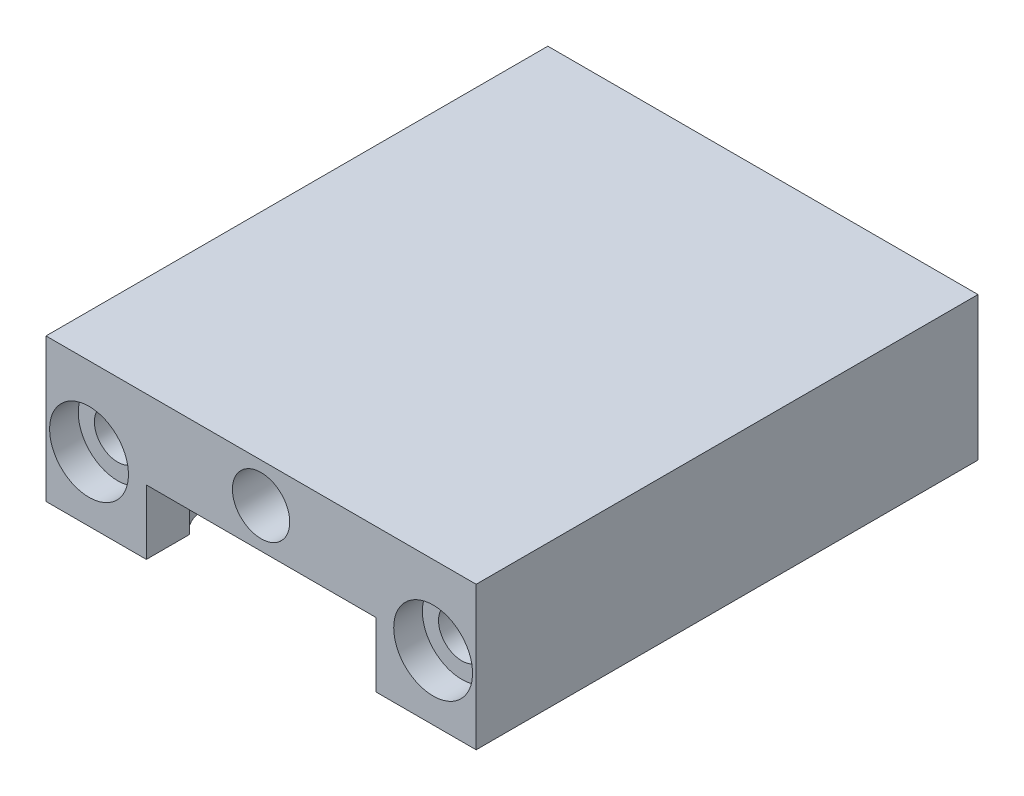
ISO-10303-21;
HEADER;
FILE_DESCRIPTION(('STEP AP214'),'2;1');
FILE_NAME('part.step','',(''),(''),'','','');
FILE_SCHEMA(('AUTOMOTIVE_DESIGN { 1 0 10303 214 1 1 1 1 }'));
ENDSEC;
DATA;
#1=APPLICATION_CONTEXT('core data for automotive mechanical design processes');
#2=APPLICATION_PROTOCOL_DEFINITION('international standard','automotive_design',2000,#1);
#3=PRODUCT_CONTEXT('',#1,'mechanical');
#4=PRODUCT('Part','Part','',(#3));
#5=PRODUCT_RELATED_PRODUCT_CATEGORY('part','',(#4));
#6=PRODUCT_DEFINITION_FORMATION('','',#4);
#7=PRODUCT_DEFINITION_CONTEXT('part definition',#1,'design');
#8=PRODUCT_DEFINITION('design','',#6,#7);
#9=PRODUCT_DEFINITION_SHAPE('','',#8);
#10=(LENGTH_UNIT() NAMED_UNIT(*) SI_UNIT(.MILLI.,.METRE.));
#11=(NAMED_UNIT(*) PLANE_ANGLE_UNIT() SI_UNIT($,.RADIAN.));
#12=(NAMED_UNIT(*) SI_UNIT($,.STERADIAN.) SOLID_ANGLE_UNIT());
#13=UNCERTAINTY_MEASURE_WITH_UNIT(LENGTH_MEASURE(1.E-05),#10,'distance_accuracy_value','');
#14=(GEOMETRIC_REPRESENTATION_CONTEXT(3) GLOBAL_UNCERTAINTY_ASSIGNED_CONTEXT((#13)) GLOBAL_UNIT_ASSIGNED_CONTEXT((#10,
#11,#12)) REPRESENTATION_CONTEXT('',''));
#15=CARTESIAN_POINT('',(0.,0.,0.));
#16=DIRECTION('',(0.,0.,1.));
#17=DIRECTION('',(1.,0.,0.));
#18=AXIS2_PLACEMENT_3D('',#15,#16,#17);
#19=CARTESIAN_POINT('',(-5.00000000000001,8.99999999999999,20.));
#20=DIRECTION('',(-1.,0.,0.));
#21=DIRECTION('',(0.,0.,1.));
#22=AXIS2_PLACEMENT_3D('',#19,#20,#21);
#23=PLANE('',#22);
#24=DIRECTION('',(0.,1.,0.));
#25=VECTOR('',#24,1.);
#26=CARTESIAN_POINT('',(-5.00000000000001,8.99999999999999,20.));
#27=LINE('',#26,#25);
#28=CARTESIAN_POINT('',(-5.00000000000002,9.49999999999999,20.));
#29=VERTEX_POINT('',#28);
#30=CARTESIAN_POINT('',(-5.00000000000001,8.99999999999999,20.));
#31=VERTEX_POINT('',#30);
#32=EDGE_CURVE('E239',#29,#31,#27,.F.);
#33=ORIENTED_EDGE('',*,*,#32,.T.);
#34=DIRECTION('',(0.,0.,1.));
#35=VECTOR('',#34,1.);
#36=CARTESIAN_POINT('',(-5.00000000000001,8.99999999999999,11.8202587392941));
#37=LINE('',#36,#35);
#38=CARTESIAN_POINT('',(-5.00000000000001,8.99999999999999,0.));
#39=VERTEX_POINT('',#38);
#40=EDGE_CURVE('E230',#31,#39,#37,.F.);
#41=ORIENTED_EDGE('',*,*,#40,.T.);
#42=DIRECTION('',(0.,1.,0.));
#43=VECTOR('',#42,1.);
#44=CARTESIAN_POINT('',(-5.00000000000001,8.99999999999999,0.));
#45=LINE('',#44,#43);
#46=CARTESIAN_POINT('',(-5.00000000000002,9.49999999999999,0.));
#47=VERTEX_POINT('',#46);
#48=EDGE_CURVE('E446',#47,#39,#45,.F.);
#49=ORIENTED_EDGE('',*,*,#48,.F.);
#50=DIRECTION('',(0.,0.,1.));
#51=VECTOR('',#50,1.);
#52=CARTESIAN_POINT('',(-5.00000000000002,9.49999999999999,11.5547539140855));
#53=LINE('',#52,#51);
#54=EDGE_CURVE('E240',#47,#29,#53,.T.);
#55=ORIENTED_EDGE('',*,*,#54,.T.);
#56=EDGE_LOOP('',(#33,#41,#49,#55));
#57=FACE_BOUND('',#56,.T.);
#58=ADVANCED_FACE('F15',(#57),#23,.F.);
#59=CARTESIAN_POINT('',(0.,8.99999999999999,20.));
#60=DIRECTION('',(0.,1.,0.));
#61=DIRECTION('',(0.,0.,1.));
#62=AXIS2_PLACEMENT_3D('',#59,#60,#61);
#63=CYLINDRICAL_SURFACE('',#62,5.);
#64=CARTESIAN_POINT('',(0.,8.99999999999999,20.));
#65=DIRECTION('',(0.,1.,0.));
#66=DIRECTION('',(0.,0.,1.));
#67=AXIS2_PLACEMENT_3D('',#64,#65,#66);
#68=CIRCLE('',#67,5.);
#69=CARTESIAN_POINT('',(-1.93649167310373,8.99999999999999,24.6097722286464));
#70=VERTEX_POINT('',#69);
#71=EDGE_CURVE('E529',#70,#31,#68,.F.);
#72=ORIENTED_EDGE('',*,*,#71,.T.);
#73=ORIENTED_EDGE('',*,*,#32,.F.);
#74=CARTESIAN_POINT('',(0.,9.49999999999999,20.));
#75=DIRECTION('',(0.,1.,0.));
#76=DIRECTION('',(0.,0.,1.));
#77=AXIS2_PLACEMENT_3D('',#74,#75,#76);
#78=CIRCLE('',#77,5.);
#79=CARTESIAN_POINT('',(0.,9.5,25.));
#80=VERTEX_POINT('',#79);
#81=EDGE_CURVE('E226',#29,#80,#78,.T.);
#82=ORIENTED_EDGE('',*,*,#81,.T.);
#83=CARTESIAN_POINT('',(0.,9.50000000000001,25.));
#84=CARTESIAN_POINT('',(-0.0969345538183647,9.50002196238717,25.0000231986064));
#85=CARTESIAN_POINT('',(-0.193853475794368,9.49647724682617,24.9971819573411));
#86=CARTESIAN_POINT('',(-0.386811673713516,9.48242167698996,24.9859452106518));
#87=CARTESIAN_POINT('',(-0.482851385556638,9.4719144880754,24.977552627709));
#88=CARTESIAN_POINT('',(-0.670943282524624,9.4444459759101,24.9556624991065));
#89=CARTESIAN_POINT('',(-0.763035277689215,9.42765128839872,24.9422968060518));
#90=CARTESIAN_POINT('',(-0.945001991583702,9.38788507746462,24.9107539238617));
#91=CARTESIAN_POINT('',(-1.03487688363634,9.36491403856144,24.8925771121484));
#92=CARTESIAN_POINT('',(-1.26584677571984,9.29731796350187,24.8393137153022));
#93=CARTESIAN_POINT('',(-1.40480523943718,9.24802480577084,24.8006702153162));
#94=CARTESIAN_POINT('',(-1.60788715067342,9.16336642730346,24.7349689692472));
#95=CARTESIAN_POINT('',(-1.67535870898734,9.13298775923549,24.7114941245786));
#96=CARTESIAN_POINT('',(-1.80780682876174,9.06892572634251,24.6622755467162));
#97=CARTESIAN_POINT('',(-1.87278489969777,9.03524440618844,24.6365332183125));
#98=CARTESIAN_POINT('',(-1.93649167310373,8.99999999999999,24.6097722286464));
#99=B_SPLINE_CURVE_WITH_KNOTS('',3,(#83,#84,#85,#86,#87,#88,#89,#90,#91,#92,#93,#94,#95,#96,#97,
#98),.UNSPECIFIED.,.F.,.F.,(4,2,2,2,2,2,2,4),(0.,0.290672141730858,0.58119138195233,
0.864501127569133,1.1477886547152,1.60358219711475,1.83635601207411,2.06898661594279),.UNSPECIFIED.);
#100=EDGE_CURVE('E237',#80,#70,#99,.T.);
#101=ORIENTED_EDGE('',*,*,#100,.T.);
#102=EDGE_LOOP('',(#72,#73,#82,#101));
#103=FACE_BOUND('',#102,.T.);
#104=ADVANCED_FACE('F236',(#103),#63,.F.);
#105=CARTESIAN_POINT('',(0.,8.99999999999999,20.));
#106=DIRECTION('',(0.,1.,0.));
#107=DIRECTION('',(0.,0.,1.));
#108=AXIS2_PLACEMENT_3D('',#105,#106,#107);
#109=CYLINDRICAL_SURFACE('',#108,5.);
#110=CARTESIAN_POINT('',(0.,9.49999999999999,20.));
#111=DIRECTION('',(0.,1.,0.));
#112=DIRECTION('',(0.,0.,1.));
#113=AXIS2_PLACEMENT_3D('',#110,#111,#112);
#114=CIRCLE('',#113,5.);
#115=CARTESIAN_POINT('',(4.99999999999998,9.49999999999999,20.));
#116=VERTEX_POINT('',#115);
#117=EDGE_CURVE('E209',#80,#116,#114,.T.);
#118=ORIENTED_EDGE('',*,*,#117,.T.);
#119=DIRECTION('',(0.,1.,0.));
#120=VECTOR('',#119,1.);
#121=CARTESIAN_POINT('',(4.99999999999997,8.99999999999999,20.));
#122=LINE('',#121,#120);
#123=CARTESIAN_POINT('',(4.99999999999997,8.99999999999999,20.));
#124=VERTEX_POINT('',#123);
#125=EDGE_CURVE('E440',#116,#124,#122,.F.);
#126=ORIENTED_EDGE('',*,*,#125,.T.);
#127=CARTESIAN_POINT('',(0.,8.99999999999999,20.));
#128=DIRECTION('',(0.,1.,0.));
#129=DIRECTION('',(0.,0.,1.));
#130=AXIS2_PLACEMENT_3D('',#127,#128,#129);
#131=CIRCLE('',#130,5.);
#132=CARTESIAN_POINT('',(1.93649167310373,8.99999999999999,24.6097722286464));
#133=VERTEX_POINT('',#132);
#134=EDGE_CURVE('E212',#124,#133,#131,.F.);
#135=ORIENTED_EDGE('',*,*,#134,.T.);
#136=CARTESIAN_POINT('',(1.93649167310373,8.99999999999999,24.6097722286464));
#137=CARTESIAN_POINT('',(1.85675661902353,9.04412193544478,24.6432765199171));
#138=CARTESIAN_POINT('',(1.7749695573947,9.08580787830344,24.6751908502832));
#139=CARTESIAN_POINT('',(1.6075329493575,9.16392844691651,24.7353711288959));
#140=CARTESIAN_POINT('',(1.52187982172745,9.20035806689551,24.7636335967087));
#141=CARTESIAN_POINT('',(1.34934820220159,9.26663969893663,24.8153045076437));
#142=CARTESIAN_POINT('',(1.26255762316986,9.29663656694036,24.8388189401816));
#143=CARTESIAN_POINT('',(1.08618661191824,9.35080748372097,24.8814382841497));
#144=CARTESIAN_POINT('',(0.996607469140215,9.37498417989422,24.9005452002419));
#145=CARTESIAN_POINT('',(0.760581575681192,9.42984524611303,24.9440114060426));
#146=CARTESIAN_POINT('',(0.61225040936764,9.45573609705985,24.964647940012));
#147=CARTESIAN_POINT('',(0.385911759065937,9.48208902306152,24.9856803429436));
#148=CARTESIAN_POINT('',(0.309005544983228,9.48879475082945,24.9910392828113));
#149=CARTESIAN_POINT('',(0.154744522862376,9.49775243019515,24.9982017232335));
#150=CARTESIAN_POINT('',(0.0773895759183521,9.50000291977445,25.0000040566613));
#151=CARTESIAN_POINT('',(0.,9.50000000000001,25.));
#152=B_SPLINE_CURVE_WITH_KNOTS('',3,(#136,#137,#138,#139,#140,#141,#142,#143,#144,#145,#146,
#147,#148,#149,#150,#151),.UNSPECIFIED.,.F.,.F.,(4,2,2,2,2,2,2,4),(0.,0.291256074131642,
0.582787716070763,0.866834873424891,1.15075258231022,1.60495167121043,1.83692318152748,
2.06897080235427),.UNSPECIFIED.);
#153=EDGE_CURVE('E206',#133,#80,#152,.T.);
#154=ORIENTED_EDGE('',*,*,#153,.T.);
#155=EDGE_LOOP('',(#118,#126,#135,#154));
#156=FACE_BOUND('',#155,.T.);
#157=ADVANCED_FACE('F208',(#156),#109,.F.);
#158=CARTESIAN_POINT('',(4.99999999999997,8.99999999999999,0.));
#159=DIRECTION('',(1.,0.,0.));
#160=DIRECTION('',(0.,0.,-1.));
#161=AXIS2_PLACEMENT_3D('',#158,#159,#160);
#162=PLANE('',#161);
#163=DIRECTION('',(0.,1.,0.));
#164=VECTOR('',#163,1.);
#165=CARTESIAN_POINT('',(4.99999999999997,8.99999999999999,0.));
#166=LINE('',#165,#164);
#167=CARTESIAN_POINT('',(4.99999999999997,8.99999999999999,0.));
#168=VERTEX_POINT('',#167);
#169=CARTESIAN_POINT('',(4.99999999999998,9.49999999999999,0.));
#170=VERTEX_POINT('',#169);
#171=EDGE_CURVE('E442',#168,#170,#166,.T.);
#172=ORIENTED_EDGE('',*,*,#171,.F.);
#173=DIRECTION('',(0.,0.,1.));
#174=VECTOR('',#173,1.);
#175=CARTESIAN_POINT('',(4.99999999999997,8.99999999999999,11.8202587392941));
#176=LINE('',#175,#174);
#177=EDGE_CURVE('E525',#168,#124,#176,.T.);
#178=ORIENTED_EDGE('',*,*,#177,.T.);
#179=ORIENTED_EDGE('',*,*,#125,.F.);
#180=DIRECTION('',(0.,0.,1.));
#181=VECTOR('',#180,1.);
#182=CARTESIAN_POINT('',(4.99999999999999,9.49999999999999,11.5547539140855));
#183=LINE('',#182,#181);
#184=EDGE_CURVE('E229',#116,#170,#183,.F.);
#185=ORIENTED_EDGE('',*,*,#184,.T.);
#186=EDGE_LOOP('',(#172,#178,#179,#185));
#187=FACE_BOUND('',#186,.T.);
#188=ADVANCED_FACE('F278',(#187),#162,.F.);
#189=CARTESIAN_POINT('',(-15.,0.,59.1010205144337));
#190=DIRECTION('',(0.,-1.,0.));
#191=DIRECTION('',(0.,0.,-1.));
#192=AXIS2_PLACEMENT_3D('',#189,#190,#191);
#193=CYLINDRICAL_SURFACE('',#192,5.);
#194=CARTESIAN_POINT('',(-15.,-4.65000000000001,59.1010205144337));
#195=DIRECTION('',(0.,-1.,0.));
#196=DIRECTION('',(0.,0.,-1.));
#197=AXIS2_PLACEMENT_3D('',#194,#195,#196);
#198=CIRCLE('',#197,5.);
#199=CARTESIAN_POINT('',(-20.,-4.65000000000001,59.1010205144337));
#200=VERTEX_POINT('',#199);
#201=CARTESIAN_POINT('',(-16.,-4.65000000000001,64.));
#202=VERTEX_POINT('',#201);
#203=EDGE_CURVE('E535',#200,#202,#198,.F.);
#204=ORIENTED_EDGE('',*,*,#203,.F.);
#205=DIRECTION('',(0.,1.,0.));
#206=VECTOR('',#205,1.);
#207=CARTESIAN_POINT('',(-20.,0.,59.1010205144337));
#208=LINE('',#207,#206);
#209=CARTESIAN_POINT('',(-20.,0.,59.1010205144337));
#210=VERTEX_POINT('',#209);
#211=EDGE_CURVE('E457',#200,#210,#208,.T.);
#212=ORIENTED_EDGE('',*,*,#211,.T.);
#213=CARTESIAN_POINT('',(-15.,0.,59.1010205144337));
#214=DIRECTION('',(0.,-1.,0.));
#215=DIRECTION('',(0.,0.,-1.));
#216=AXIS2_PLACEMENT_3D('',#213,#214,#215);
#217=CIRCLE('',#216,5.);
#218=CARTESIAN_POINT('',(-16.,0.,64.));
#219=VERTEX_POINT('',#218);
#220=EDGE_CURVE('E518',#219,#210,#217,.T.);
#221=ORIENTED_EDGE('',*,*,#220,.F.);
#222=DIRECTION('',(0.,1.,0.));
#223=VECTOR('',#222,1.);
#224=CARTESIAN_POINT('',(-16.,0.,64.));
#225=LINE('',#224,#223);
#226=EDGE_CURVE('E558',#202,#219,#225,.T.);
#227=ORIENTED_EDGE('',*,*,#226,.F.);
#228=EDGE_LOOP('',(#204,#212,#221,#227));
#229=FACE_BOUND('',#228,.T.);
#230=ADVANCED_FACE('F281',(#229),#193,.F.);
#231=CARTESIAN_POINT('',(-5.00000000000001,0.,20.));
#232=DIRECTION('',(0.,1.,0.));
#233=DIRECTION('',(0.,0.,1.));
#234=AXIS2_PLACEMENT_3D('',#231,#232,#233);
#235=CYLINDRICAL_SURFACE('',#234,5.);
#236=DIRECTION('',(0.,1.,0.));
#237=VECTOR('',#236,1.);
#238=CARTESIAN_POINT('',(-5.00000000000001,0.,25.));
#239=LINE('',#238,#237);
#240=CARTESIAN_POINT('',(-5.00000000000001,8.99999999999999,25.));
#241=VERTEX_POINT('',#240);
#242=CARTESIAN_POINT('',(-5.00000000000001,0.,25.));
#243=VERTEX_POINT('',#242);
#244=EDGE_CURVE('E444',#241,#243,#239,.F.);
#245=ORIENTED_EDGE('',*,*,#244,.T.);
#246=CARTESIAN_POINT('',(-5.00000000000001,0.,20.));
#247=DIRECTION('',(0.,1.,0.));
#248=DIRECTION('',(0.,0.,1.));
#249=AXIS2_PLACEMENT_3D('',#246,#247,#248);
#250=CIRCLE('',#249,5.);
#251=CARTESIAN_POINT('',(-10.,0.,20.));
#252=VERTEX_POINT('',#251);
#253=EDGE_CURVE('E514',#252,#243,#250,.T.);
#254=ORIENTED_EDGE('',*,*,#253,.F.);
#255=DIRECTION('',(0.,1.,0.));
#256=VECTOR('',#255,1.);
#257=CARTESIAN_POINT('',(-10.,0.,20.));
#258=LINE('',#257,#256);
#259=CARTESIAN_POINT('',(-10.,8.99999999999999,20.));
#260=VERTEX_POINT('',#259);
#261=EDGE_CURVE('E456',#252,#260,#258,.T.);
#262=ORIENTED_EDGE('',*,*,#261,.T.);
#263=CARTESIAN_POINT('',(-5.00000000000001,8.99999999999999,20.));
#264=DIRECTION('',(0.,1.,0.));
#265=DIRECTION('',(0.,0.,1.));
#266=AXIS2_PLACEMENT_3D('',#263,#264,#265);
#267=CIRCLE('',#266,5.);
#268=EDGE_CURVE('E531',#260,#241,#267,.T.);
#269=ORIENTED_EDGE('',*,*,#268,.T.);
#270=EDGE_LOOP('',(#245,#254,#262,#269));
#271=FACE_BOUND('',#270,.T.);
#272=ADVANCED_FACE('F285',(#271),#235,.F.);
#273=CARTESIAN_POINT('',(5.,0.,25.));
#274=DIRECTION('',(0.,0.,1.));
#275=DIRECTION('',(1.,0.,0.));
#276=AXIS2_PLACEMENT_3D('',#273,#274,#275);
#277=PLANE('',#276);
#278=DIRECTION('',(1.,0.,0.));
#279=VECTOR('',#278,1.);
#280=CARTESIAN_POINT('',(0.,8.99999999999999,25.));
#281=LINE('',#280,#279);
#282=CARTESIAN_POINT('',(1.93649167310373,8.99999999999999,25.));
#283=VERTEX_POINT('',#282);
#284=CARTESIAN_POINT('',(5.,8.99999999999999,25.));
#285=VERTEX_POINT('',#284);
#286=EDGE_CURVE('E526',#283,#285,#281,.T.);
#287=ORIENTED_EDGE('',*,*,#286,.T.);
#288=DIRECTION('',(0.,1.,0.));
#289=VECTOR('',#288,1.);
#290=CARTESIAN_POINT('',(5.,0.,25.));
#291=LINE('',#290,#289);
#292=CARTESIAN_POINT('',(5.,0.,25.));
#293=VERTEX_POINT('',#292);
#294=EDGE_CURVE('E559',#285,#293,#291,.F.);
#295=ORIENTED_EDGE('',*,*,#294,.T.);
#296=DIRECTION('',(1.,0.,0.));
#297=VECTOR('',#296,1.);
#298=CARTESIAN_POINT('',(16.,0.,25.));
#299=LINE('',#298,#297);
#300=EDGE_CURVE('E513',#243,#293,#299,.T.);
#301=ORIENTED_EDGE('',*,*,#300,.F.);
#302=ORIENTED_EDGE('',*,*,#244,.F.);
#303=DIRECTION('',(1.,0.,0.));
#304=VECTOR('',#303,1.);
#305=CARTESIAN_POINT('',(0.,8.99999999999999,25.));
#306=LINE('',#305,#304);
#307=CARTESIAN_POINT('',(-1.93649167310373,8.99999999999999,25.));
#308=VERTEX_POINT('',#307);
#309=EDGE_CURVE('E533',#241,#308,#306,.T.);
#310=ORIENTED_EDGE('',*,*,#309,.T.);
#311=CARTESIAN_POINT('',(0.,5.50000000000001,25.));
#312=DIRECTION('',(0.,0.,1.));
#313=DIRECTION('',(1.,0.,0.));
#314=AXIS2_PLACEMENT_3D('',#311,#312,#313);
#315=CIRCLE('',#314,4.);
#316=EDGE_CURVE('E218',#308,#283,#315,.T.);
#317=ORIENTED_EDGE('',*,*,#316,.T.);
#318=EDGE_LOOP('',(#287,#295,#301,#302,#310,#317));
#319=FACE_BOUND('',#318,.T.);
#320=ADVANCED_FACE('F289',(#319),#277,.F.);
#321=CARTESIAN_POINT('',(5.,0.,20.));
#322=DIRECTION('',(0.,1.,0.));
#323=DIRECTION('',(0.,0.,1.));
#324=AXIS2_PLACEMENT_3D('',#321,#322,#323);
#325=CYLINDRICAL_SURFACE('',#324,4.99999999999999);
#326=DIRECTION('',(0.,1.,0.));
#327=VECTOR('',#326,1.);
#328=CARTESIAN_POINT('',(10.,0.,20.));
#329=LINE('',#328,#327);
#330=CARTESIAN_POINT('',(10.,8.99999999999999,20.));
#331=VERTEX_POINT('',#330);
#332=CARTESIAN_POINT('',(10.,0.,20.));
#333=VERTEX_POINT('',#332);
#334=EDGE_CURVE('E435',#331,#333,#329,.F.);
#335=ORIENTED_EDGE('',*,*,#334,.T.);
#336=CARTESIAN_POINT('',(5.,0.,20.));
#337=DIRECTION('',(0.,1.,0.));
#338=DIRECTION('',(0.,0.,1.));
#339=AXIS2_PLACEMENT_3D('',#336,#337,#338);
#340=CIRCLE('',#339,4.99999999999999);
#341=EDGE_CURVE('E510',#293,#333,#340,.T.);
#342=ORIENTED_EDGE('',*,*,#341,.F.);
#343=ORIENTED_EDGE('',*,*,#294,.F.);
#344=CARTESIAN_POINT('',(5.,8.99999999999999,20.));
#345=DIRECTION('',(0.,1.,0.));
#346=DIRECTION('',(0.,0.,1.));
#347=AXIS2_PLACEMENT_3D('',#344,#345,#346);
#348=CIRCLE('',#347,4.99999999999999);
#349=EDGE_CURVE('E523',#285,#331,#348,.T.);
#350=ORIENTED_EDGE('',*,*,#349,.T.);
#351=EDGE_LOOP('',(#335,#342,#343,#350));
#352=FACE_BOUND('',#351,.T.);
#353=ADVANCED_FACE('F293',(#352),#325,.F.);
#354=CARTESIAN_POINT('',(13.,-9.00000000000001,60.));
#355=DIRECTION('',(0.,1.,0.));
#356=DIRECTION('',(-1.,0.,0.));
#357=AXIS2_PLACEMENT_3D('',#354,#355,#356);
#358=CYLINDRICAL_SURFACE('',#357,5.);
#359=DIRECTION('',(0.,1.,0.));
#360=VECTOR('',#359,1.);
#361=CARTESIAN_POINT('',(18.,-9.00000000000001,60.));
#362=LINE('',#361,#360);
#363=CARTESIAN_POINT('',(18.,-4.65000000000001,60.));
#364=VERTEX_POINT('',#363);
#365=CARTESIAN_POINT('',(18.,-9.00000000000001,60.));
#366=VERTEX_POINT('',#365);
#367=EDGE_CURVE('E217',#364,#366,#362,.F.);
#368=ORIENTED_EDGE('',*,*,#367,.T.);
#369=CARTESIAN_POINT('',(13.,-9.,60.));
#370=DIRECTION('',(0.,1.,0.));
#371=DIRECTION('',(-1.,0.,0.));
#372=AXIS2_PLACEMENT_3D('',#369,#370,#371);
#373=CIRCLE('',#372,5.);
#374=CARTESIAN_POINT('',(16.,-9.00000000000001,64.));
#375=VERTEX_POINT('',#374);
#376=EDGE_CURVE('E273',#375,#366,#373,.T.);
#377=ORIENTED_EDGE('',*,*,#376,.F.);
#378=DIRECTION('',(0.,1.,0.));
#379=VECTOR('',#378,1.);
#380=CARTESIAN_POINT('',(16.,-9.,64.));
#381=LINE('',#380,#379);
#382=CARTESIAN_POINT('',(16.,-4.65000000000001,64.));
#383=VERTEX_POINT('',#382);
#384=EDGE_CURVE('E462',#383,#375,#381,.F.);
#385=ORIENTED_EDGE('',*,*,#384,.F.);
#386=CARTESIAN_POINT('',(13.,-4.65000000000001,60.));
#387=DIRECTION('',(0.,1.,0.));
#388=DIRECTION('',(-1.,0.,0.));
#389=AXIS2_PLACEMENT_3D('',#386,#387,#388);
#390=CIRCLE('',#389,5.);
#391=EDGE_CURVE('E501',#364,#383,#390,.F.);
#392=ORIENTED_EDGE('',*,*,#391,.F.);
#393=EDGE_LOOP('',(#368,#377,#385,#392));
#394=FACE_BOUND('',#393,.T.);
#395=ADVANCED_FACE('F297',(#394),#358,.F.);
#396=CARTESIAN_POINT('',(15.,0.,59.1010205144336));
#397=DIRECTION('',(0.,-1.,0.));
#398=DIRECTION('',(0.,0.,-1.));
#399=AXIS2_PLACEMENT_3D('',#396,#397,#398);
#400=CYLINDRICAL_SURFACE('',#399,5.);
#401=CARTESIAN_POINT('',(15.,0.,59.1010205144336));
#402=DIRECTION('',(0.,-1.,0.));
#403=DIRECTION('',(0.,0.,-1.));
#404=AXIS2_PLACEMENT_3D('',#401,#402,#403);
#405=CIRCLE('',#404,5.);
#406=CARTESIAN_POINT('',(20.,0.,59.1010205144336));
#407=VERTEX_POINT('',#406);
#408=CARTESIAN_POINT('',(16.,0.,64.));
#409=VERTEX_POINT('',#408);
#410=EDGE_CURVE('E505',#407,#409,#405,.T.);
#411=ORIENTED_EDGE('',*,*,#410,.F.);
#412=DIRECTION('',(0.,1.,0.));
#413=VECTOR('',#412,1.);
#414=CARTESIAN_POINT('',(20.,0.,59.1010205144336));
#415=LINE('',#414,#413);
#416=CARTESIAN_POINT('',(20.,-4.65000000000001,59.1010205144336));
#417=VERTEX_POINT('',#416);
#418=EDGE_CURVE('E504',#407,#417,#415,.F.);
#419=ORIENTED_EDGE('',*,*,#418,.T.);
#420=CARTESIAN_POINT('',(15.,-4.65000000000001,59.1010205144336));
#421=DIRECTION('',(0.,-1.,0.));
#422=DIRECTION('',(0.,0.,-1.));
#423=AXIS2_PLACEMENT_3D('',#420,#421,#422);
#424=CIRCLE('',#423,5.);
#425=EDGE_CURVE('E497',#383,#417,#424,.F.);
#426=ORIENTED_EDGE('',*,*,#425,.F.);
#427=DIRECTION('',(0.,1.,0.));
#428=VECTOR('',#427,1.);
#429=CARTESIAN_POINT('',(16.,-9.,64.));
#430=LINE('',#429,#428);
#431=EDGE_CURVE('E430',#409,#383,#430,.F.);
#432=ORIENTED_EDGE('',*,*,#431,.F.);
#433=EDGE_LOOP('',(#411,#419,#426,#432));
#434=FACE_BOUND('',#433,.T.);
#435=ADVANCED_FACE('F301',(#434),#400,.F.);
#436=CARTESIAN_POINT('',(-29.61,5.61,66.));
#437=DIRECTION('',(0.,0.,-1.));
#438=DIRECTION('',(1.,0.,0.));
#439=AXIS2_PLACEMENT_3D('',#436,#437,#438);
#440=PLANE('',#439);
#441=CARTESIAN_POINT('',(-24.,0.,66.));
#442=DIRECTION('',(0.,0.,1.));
#443=DIRECTION('',(1.,0.,0.));
#444=AXIS2_PLACEMENT_3D('',#441,#442,#443);
#445=CIRCLE('',#444,3.25);
#446=CARTESIAN_POINT('',(-20.75,0.,66.));
#447=VERTEX_POINT('',#446);
#448=EDGE_CURVE('E493',#447,#447,#445,.F.);
#449=ORIENTED_EDGE('',*,*,#448,.T.);
#450=EDGE_LOOP('',(#449));
#451=FACE_BOUND('',#450,.T.);
#452=CARTESIAN_POINT('',(-24.,0.,66.));
#453=DIRECTION('',(0.,0.,-1.));
#454=DIRECTION('',(-1.,0.,0.));
#455=AXIS2_PLACEMENT_3D('',#452,#453,#454);
#456=CIRCLE('',#455,5.5);
#457=CARTESIAN_POINT('',(-29.5,0.,66.));
#458=VERTEX_POINT('',#457);
#459=EDGE_CURVE('E247',#458,#458,#456,.F.);
#460=ORIENTED_EDGE('',*,*,#459,.T.);
#461=EDGE_LOOP('',(#460));
#462=FACE_BOUND('',#461,.T.);
#463=ADVANCED_FACE('F305',(#451,#462),#440,.F.);
#464=CARTESIAN_POINT('',(18.39,5.61,66.));
#465=DIRECTION('',(0.,0.,-1.));
#466=DIRECTION('',(1.,0.,0.));
#467=AXIS2_PLACEMENT_3D('',#464,#465,#466);
#468=PLANE('',#467);
#469=CARTESIAN_POINT('',(24.,0.,66.));
#470=DIRECTION('',(0.,0.,1.));
#471=DIRECTION('',(1.,0.,0.));
#472=AXIS2_PLACEMENT_3D('',#469,#470,#471);
#473=CIRCLE('',#472,3.25);
#474=CARTESIAN_POINT('',(27.25,0.,66.));
#475=VERTEX_POINT('',#474);
#476=EDGE_CURVE('E490',#475,#475,#473,.F.);
#477=ORIENTED_EDGE('',*,*,#476,.T.);
#478=EDGE_LOOP('',(#477));
#479=FACE_BOUND('',#478,.T.);
#480=CARTESIAN_POINT('',(24.,0.,66.));
#481=DIRECTION('',(0.,0.,-1.));
#482=DIRECTION('',(-1.,0.,0.));
#483=AXIS2_PLACEMENT_3D('',#480,#481,#482);
#484=CIRCLE('',#483,5.5);
#485=CARTESIAN_POINT('',(18.5,0.,66.));
#486=VERTEX_POINT('',#485);
#487=EDGE_CURVE('E19',#486,#486,#484,.F.);
#488=ORIENTED_EDGE('',*,*,#487,.T.);
#489=EDGE_LOOP('',(#488));
#490=FACE_BOUND('',#489,.T.);
#491=ADVANCED_FACE('F310',(#479,#490),#468,.F.);
#492=CARTESIAN_POINT('',(-13.,-9.,60.));
#493=DIRECTION('',(0.,1.,0.));
#494=DIRECTION('',(-1.,0.,0.));
#495=AXIS2_PLACEMENT_3D('',#492,#493,#494);
#496=CYLINDRICAL_SURFACE('',#495,5.00000000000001);
#497=DIRECTION('',(0.,1.,0.));
#498=VECTOR('',#497,1.);
#499=CARTESIAN_POINT('',(-16.,0.,64.));
#500=LINE('',#499,#498);
#501=CARTESIAN_POINT('',(-16.,-9.,64.));
#502=VERTEX_POINT('',#501);
#503=EDGE_CURVE('E555',#502,#202,#500,.T.);
#504=ORIENTED_EDGE('',*,*,#503,.F.);
#505=CARTESIAN_POINT('',(-13.,-9.,60.));
#506=DIRECTION('',(0.,1.,0.));
#507=DIRECTION('',(-1.,0.,0.));
#508=AXIS2_PLACEMENT_3D('',#505,#506,#507);
#509=CIRCLE('',#508,5.00000000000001);
#510=CARTESIAN_POINT('',(-18.,-9.,60.));
#511=VERTEX_POINT('',#510);
#512=EDGE_CURVE('E486',#511,#502,#509,.T.);
#513=ORIENTED_EDGE('',*,*,#512,.F.);
#514=DIRECTION('',(0.,1.,0.));
#515=VECTOR('',#514,1.);
#516=CARTESIAN_POINT('',(-18.,-9.,60.));
#517=LINE('',#516,#515);
#518=CARTESIAN_POINT('',(-18.,-4.65000000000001,60.));
#519=VERTEX_POINT('',#518);
#520=EDGE_CURVE('E540',#511,#519,#517,.T.);
#521=ORIENTED_EDGE('',*,*,#520,.T.);
#522=CARTESIAN_POINT('',(-13.,-4.65000000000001,60.));
#523=DIRECTION('',(0.,1.,0.));
#524=DIRECTION('',(-1.,0.,0.));
#525=AXIS2_PLACEMENT_3D('',#522,#523,#524);
#526=CIRCLE('',#525,5.00000000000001);
#527=EDGE_CURVE('E538',#202,#519,#526,.F.);
#528=ORIENTED_EDGE('',*,*,#527,.F.);
#529=EDGE_LOOP('',(#504,#513,#521,#528));
#530=FACE_BOUND('',#529,.T.);
#531=ADVANCED_FACE('F307',(#530),#496,.F.);
#532=CARTESIAN_POINT('',(-16.,0.,0.));
#533=DIRECTION('',(1.,0.,0.));
#534=DIRECTION('',(0.,0.,-1.));
#535=AXIS2_PLACEMENT_3D('',#532,#533,#534);
#536=PLANE('',#535);
#537=DIRECTION('',(0.,1.,0.));
#538=VECTOR('',#537,1.);
#539=CARTESIAN_POINT('',(-16.,2.06179775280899,70.));
#540=LINE('',#539,#538);
#541=CARTESIAN_POINT('',(-16.,-9.,70.));
#542=VERTEX_POINT('',#541);
#543=CARTESIAN_POINT('',(-16.,0.,70.));
#544=VERTEX_POINT('',#543);
#545=EDGE_CURVE('E426',#542,#544,#540,.T.);
#546=ORIENTED_EDGE('',*,*,#545,.F.);
#547=DIRECTION('',(0.,0.,-1.));
#548=VECTOR('',#547,1.);
#549=CARTESIAN_POINT('',(-16.,-9.,0.));
#550=LINE('',#549,#548);
#551=EDGE_CURVE('E489',#502,#542,#550,.F.);
#552=ORIENTED_EDGE('',*,*,#551,.F.);
#553=ORIENTED_EDGE('',*,*,#503,.T.);
#554=ORIENTED_EDGE('',*,*,#226,.T.);
#555=DIRECTION('',(0.,0.,-1.));
#556=VECTOR('',#555,1.);
#557=CARTESIAN_POINT('',(-16.,0.,0.));
#558=LINE('',#557,#556);
#559=EDGE_CURVE('E522',#544,#219,#558,.T.);
#560=ORIENTED_EDGE('',*,*,#559,.F.);
#561=EDGE_LOOP('',(#546,#552,#553,#554,#560));
#562=FACE_BOUND('',#561,.T.);
#563=ADVANCED_FACE('F309',(#562),#536,.T.);
#564=CARTESIAN_POINT('',(16.,-9.,0.));
#565=DIRECTION('',(-1.,0.,0.));
#566=DIRECTION('',(0.,0.,1.));
#567=AXIS2_PLACEMENT_3D('',#564,#565,#566);
#568=PLANE('',#567);
#569=DIRECTION('',(0.,1.,0.));
#570=VECTOR('',#569,1.);
#571=CARTESIAN_POINT('',(16.,2.06179775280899,70.));
#572=LINE('',#571,#570);
#573=CARTESIAN_POINT('',(16.,0.,70.));
#574=VERTEX_POINT('',#573);
#575=CARTESIAN_POINT('',(16.,-9.00000000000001,70.));
#576=VERTEX_POINT('',#575);
#577=EDGE_CURVE('E417',#574,#576,#572,.F.);
#578=ORIENTED_EDGE('',*,*,#577,.F.);
#579=DIRECTION('',(0.,0.,-1.));
#580=VECTOR('',#579,1.);
#581=CARTESIAN_POINT('',(16.,0.,0.));
#582=LINE('',#581,#580);
#583=EDGE_CURVE('E434',#409,#574,#582,.F.);
#584=ORIENTED_EDGE('',*,*,#583,.F.);
#585=ORIENTED_EDGE('',*,*,#431,.T.);
#586=ORIENTED_EDGE('',*,*,#384,.T.);
#587=DIRECTION('',(0.,0.,-1.));
#588=VECTOR('',#587,1.);
#589=CARTESIAN_POINT('',(16.,-9.00000000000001,0.));
#590=LINE('',#589,#588);
#591=EDGE_CURVE('E411',#576,#375,#590,.T.);
#592=ORIENTED_EDGE('',*,*,#591,.F.);
#593=EDGE_LOOP('',(#578,#584,#585,#586,#592));
#594=FACE_BOUND('',#593,.T.);
#595=ADVANCED_FACE('F266',(#594),#568,.T.);
#596=CARTESIAN_POINT('',(24.,0.,70.));
#597=DIRECTION('',(0.,0.,-1.));
#598=DIRECTION('',(-1.,0.,0.));
#599=AXIS2_PLACEMENT_3D('',#596,#597,#598);
#600=CYLINDRICAL_SURFACE('',#599,5.5);
#601=ORIENTED_EDGE('',*,*,#487,.F.);
#602=EDGE_LOOP('',(#601));
#603=FACE_BOUND('',#602,.T.);
#604=CARTESIAN_POINT('',(24.,0.,70.));
#605=DIRECTION('',(0.,0.,-1.));
#606=DIRECTION('',(-1.,0.,0.));
#607=AXIS2_PLACEMENT_3D('',#604,#605,#606);
#608=CIRCLE('',#607,5.5);
#609=CARTESIAN_POINT('',(18.5,0.,70.));
#610=VERTEX_POINT('',#609);
#611=EDGE_CURVE('E416',#610,#610,#608,.T.);
#612=ORIENTED_EDGE('',*,*,#611,.F.);
#613=EDGE_LOOP('',(#612));
#614=FACE_BOUND('',#613,.T.);
#615=ADVANCED_FACE('F318',(#603,#614),#600,.F.);
#616=CARTESIAN_POINT('',(-24.,0.,70.));
#617=DIRECTION('',(0.,0.,-1.));
#618=DIRECTION('',(-1.,0.,0.));
#619=AXIS2_PLACEMENT_3D('',#616,#617,#618);
#620=CYLINDRICAL_SURFACE('',#619,5.5);
#621=ORIENTED_EDGE('',*,*,#459,.F.);
#622=EDGE_LOOP('',(#621));
#623=FACE_BOUND('',#622,.T.);
#624=CARTESIAN_POINT('',(-24.,0.,70.));
#625=DIRECTION('',(0.,0.,-1.));
#626=DIRECTION('',(-1.,0.,0.));
#627=AXIS2_PLACEMENT_3D('',#624,#625,#626);
#628=CIRCLE('',#627,5.5);
#629=CARTESIAN_POINT('',(-29.5,0.,70.));
#630=VERTEX_POINT('',#629);
#631=EDGE_CURVE('E481',#630,#630,#628,.T.);
#632=ORIENTED_EDGE('',*,*,#631,.F.);
#633=EDGE_LOOP('',(#632));
#634=FACE_BOUND('',#633,.T.);
#635=ADVANCED_FACE('F17',(#623,#634),#620,.F.);
#636=CARTESIAN_POINT('',(0.,5.50000000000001,0.));
#637=DIRECTION('',(0.,0.,1.));
#638=DIRECTION('',(1.,0.,0.));
#639=AXIS2_PLACEMENT_3D('',#636,#637,#638);
#640=CYLINDRICAL_SURFACE('',#639,4.);
#641=CARTESIAN_POINT('',(0.,5.50000000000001,70.));
#642=DIRECTION('',(0.,0.,1.));
#643=DIRECTION('',(1.,0.,0.));
#644=AXIS2_PLACEMENT_3D('',#641,#642,#643);
#645=CIRCLE('',#644,4.);
#646=CARTESIAN_POINT('',(4.,5.50000000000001,70.));
#647=VERTEX_POINT('',#646);
#648=EDGE_CURVE('E477',#647,#647,#645,.F.);
#649=ORIENTED_EDGE('',*,*,#648,.F.);
#650=EDGE_LOOP('',(#649));
#651=FACE_BOUND('',#650,.T.);
#652=DIRECTION('',(0.,0.,1.));
#653=VECTOR('',#652,1.);
#654=CARTESIAN_POINT('',(1.93649167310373,8.99999999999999,11.8202587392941));
#655=LINE('',#654,#653);
#656=EDGE_CURVE('E527',#133,#283,#655,.T.);
#657=ORIENTED_EDGE('',*,*,#656,.T.);
#658=ORIENTED_EDGE('',*,*,#316,.F.);
#659=DIRECTION('',(0.,0.,1.));
#660=VECTOR('',#659,1.);
#661=CARTESIAN_POINT('',(-1.93649167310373,8.99999999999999,11.8202587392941));
#662=LINE('',#661,#660);
#663=EDGE_CURVE('E245',#308,#70,#662,.F.);
#664=ORIENTED_EDGE('',*,*,#663,.T.);
#665=ORIENTED_EDGE('',*,*,#100,.F.);
#666=ORIENTED_EDGE('',*,*,#153,.F.);
#667=EDGE_LOOP('',(#657,#658,#664,#665,#666));
#668=FACE_BOUND('',#667,.T.);
#669=ADVANCED_FACE('F242',(#651,#668),#640,.F.);
#670=CARTESIAN_POINT('',(18.,-9.00000000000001,0.));
#671=DIRECTION('',(1.,0.,0.));
#672=DIRECTION('',(0.,0.,-1.));
#673=AXIS2_PLACEMENT_3D('',#670,#671,#672);
#674=PLANE('',#673);
#675=DIRECTION('',(0.,1.,0.));
#676=VECTOR('',#675,1.);
#677=CARTESIAN_POINT('',(18.,2.06179775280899,0.));
#678=LINE('',#677,#676);
#679=CARTESIAN_POINT('',(18.,-4.65000000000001,0.));
#680=VERTEX_POINT('',#679);
#681=CARTESIAN_POINT('',(18.,-9.00000000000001,0.));
#682=VERTEX_POINT('',#681);
#683=EDGE_CURVE('E468',#680,#682,#678,.F.);
#684=ORIENTED_EDGE('',*,*,#683,.T.);
#685=DIRECTION('',(0.,0.,-1.));
#686=VECTOR('',#685,1.);
#687=CARTESIAN_POINT('',(18.,-9.00000000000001,0.));
#688=LINE('',#687,#686);
#689=EDGE_CURVE('E547',#366,#682,#688,.T.);
#690=ORIENTED_EDGE('',*,*,#689,.F.);
#691=ORIENTED_EDGE('',*,*,#367,.F.);
#692=DIRECTION('',(0.,0.,1.));
#693=VECTOR('',#692,1.);
#694=CARTESIAN_POINT('',(18.,-4.65000000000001,31.3532872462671));
#695=LINE('',#694,#693);
#696=EDGE_CURVE('E496',#680,#364,#695,.T.);
#697=ORIENTED_EDGE('',*,*,#696,.F.);
#698=EDGE_LOOP('',(#684,#690,#691,#697));
#699=FACE_BOUND('',#698,.T.);
#700=ADVANCED_FACE('F263',(#699),#674,.F.);
#701=CARTESIAN_POINT('',(30.,-9.00000000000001,0.));
#702=DIRECTION('',(0.,-1.,0.));
#703=DIRECTION('',(0.,0.,-1.));
#704=AXIS2_PLACEMENT_3D('',#701,#702,#703);
#705=PLANE('',#704);
#706=DIRECTION('',(1.,0.,0.));
#707=VECTOR('',#706,1.);
#708=CARTESIAN_POINT('',(0.,-9.,70.));
#709=LINE('',#708,#707);
#710=CARTESIAN_POINT('',(30.,-9.00000000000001,70.));
#711=VERTEX_POINT('',#710);
#712=EDGE_CURVE('E408',#576,#711,#709,.T.);
#713=ORIENTED_EDGE('',*,*,#712,.F.);
#714=ORIENTED_EDGE('',*,*,#591,.T.);
#715=ORIENTED_EDGE('',*,*,#376,.T.);
#716=ORIENTED_EDGE('',*,*,#689,.T.);
#717=DIRECTION('',(1.,0.,0.));
#718=VECTOR('',#717,1.);
#719=CARTESIAN_POINT('',(0.,-9.00000000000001,0.));
#720=LINE('',#719,#718);
#721=CARTESIAN_POINT('',(30.,-9.00000000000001,0.));
#722=VERTEX_POINT('',#721);
#723=EDGE_CURVE('E465',#682,#722,#720,.T.);
#724=ORIENTED_EDGE('',*,*,#723,.T.);
#725=DIRECTION('',(0.,0.,-1.));
#726=VECTOR('',#725,1.);
#727=CARTESIAN_POINT('',(30.,-9.00000000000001,0.));
#728=LINE('',#727,#726);
#729=EDGE_CURVE('E413',#711,#722,#728,.T.);
#730=ORIENTED_EDGE('',*,*,#729,.F.);
#731=EDGE_LOOP('',(#713,#714,#715,#716,#724,#730));
#732=FACE_BOUND('',#731,.T.);
#733=ADVANCED_FACE('F397',(#732),#705,.T.);
#734=CARTESIAN_POINT('',(-18.,-9.,60.));
#735=DIRECTION('',(-1.,0.,0.));
#736=DIRECTION('',(0.,0.,1.));
#737=AXIS2_PLACEMENT_3D('',#734,#735,#736);
#738=PLANE('',#737);
#739=ORIENTED_EDGE('',*,*,#520,.F.);
#740=DIRECTION('',(0.,0.,-1.));
#741=VECTOR('',#740,1.);
#742=CARTESIAN_POINT('',(-18.,-9.,0.));
#743=LINE('',#742,#741);
#744=CARTESIAN_POINT('',(-18.,-9.,0.));
#745=VERTEX_POINT('',#744);
#746=EDGE_CURVE('E564',#745,#511,#743,.F.);
#747=ORIENTED_EDGE('',*,*,#746,.F.);
#748=DIRECTION('',(0.,1.,0.));
#749=VECTOR('',#748,1.);
#750=CARTESIAN_POINT('',(-18.,2.06179775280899,0.));
#751=LINE('',#750,#749);
#752=CARTESIAN_POINT('',(-18.,-4.65000000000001,0.));
#753=VERTEX_POINT('',#752);
#754=EDGE_CURVE('E461',#745,#753,#751,.T.);
#755=ORIENTED_EDGE('',*,*,#754,.T.);
#756=DIRECTION('',(0.,0.,1.));
#757=VECTOR('',#756,1.);
#758=CARTESIAN_POINT('',(-18.,-4.65000000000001,31.3532872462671));
#759=LINE('',#758,#757);
#760=EDGE_CURVE('E537',#519,#753,#759,.F.);
#761=ORIENTED_EDGE('',*,*,#760,.F.);
#762=EDGE_LOOP('',(#739,#747,#755,#761));
#763=FACE_BOUND('',#762,.T.);
#764=ADVANCED_FACE('F394',(#763),#738,.F.);
#765=CARTESIAN_POINT('',(0.,-4.65000000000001,31.3532872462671));
#766=DIRECTION('',(0.,1.,0.));
#767=DIRECTION('',(0.,0.,1.));
#768=AXIS2_PLACEMENT_3D('',#765,#766,#767);
#769=PLANE('',#768);
#770=DIRECTION('',(0.,0.,1.));
#771=VECTOR('',#770,1.);
#772=CARTESIAN_POINT('',(-20.,-4.65000000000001,0.));
#773=LINE('',#772,#771);
#774=CARTESIAN_POINT('',(-20.,-4.65000000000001,0.));
#775=VERTEX_POINT('',#774);
#776=EDGE_CURVE('E453',#775,#200,#773,.T.);
#777=ORIENTED_EDGE('',*,*,#776,.T.);
#778=ORIENTED_EDGE('',*,*,#203,.T.);
#779=ORIENTED_EDGE('',*,*,#527,.T.);
#780=ORIENTED_EDGE('',*,*,#760,.T.);
#781=DIRECTION('',(1.,0.,0.));
#782=VECTOR('',#781,1.);
#783=CARTESIAN_POINT('',(0.,-4.65000000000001,0.));
#784=LINE('',#783,#782);
#785=EDGE_CURVE('E458',#753,#775,#784,.F.);
#786=ORIENTED_EDGE('',*,*,#785,.T.);
#787=EDGE_LOOP('',(#777,#778,#779,#780,#786));
#788=FACE_BOUND('',#787,.T.);
#789=ADVANCED_FACE('F390',(#788),#769,.T.);
#790=CARTESIAN_POINT('',(-20.,0.,0.));
#791=DIRECTION('',(-1.,0.,0.));
#792=DIRECTION('',(0.,0.,1.));
#793=AXIS2_PLACEMENT_3D('',#790,#791,#792);
#794=PLANE('',#793);
#795=DIRECTION('',(0.,1.,0.));
#796=VECTOR('',#795,1.);
#797=CARTESIAN_POINT('',(-20.,2.06179775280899,0.));
#798=LINE('',#797,#796);
#799=CARTESIAN_POINT('',(-20.,0.,0.));
#800=VERTEX_POINT('',#799);
#801=EDGE_CURVE('E460',#775,#800,#798,.T.);
#802=ORIENTED_EDGE('',*,*,#801,.T.);
#803=DIRECTION('',(0.,0.,-1.));
#804=VECTOR('',#803,1.);
#805=CARTESIAN_POINT('',(-20.,0.,0.));
#806=LINE('',#805,#804);
#807=EDGE_CURVE('E521',#210,#800,#806,.T.);
#808=ORIENTED_EDGE('',*,*,#807,.F.);
#809=ORIENTED_EDGE('',*,*,#211,.F.);
#810=ORIENTED_EDGE('',*,*,#776,.F.);
#811=EDGE_LOOP('',(#802,#808,#809,#810));
#812=FACE_BOUND('',#811,.T.);
#813=ADVANCED_FACE('F386',(#812),#794,.F.);
#814=CARTESIAN_POINT('',(-10.,0.,20.));
#815=DIRECTION('',(-1.,0.,0.));
#816=DIRECTION('',(0.,0.,1.));
#817=AXIS2_PLACEMENT_3D('',#814,#815,#816);
#818=PLANE('',#817);
#819=ORIENTED_EDGE('',*,*,#261,.F.);
#820=DIRECTION('',(0.,0.,-1.));
#821=VECTOR('',#820,1.);
#822=CARTESIAN_POINT('',(-9.99999999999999,0.,0.));
#823=LINE('',#822,#821);
#824=CARTESIAN_POINT('',(-9.99999999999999,0.,0.));
#825=VERTEX_POINT('',#824);
#826=EDGE_CURVE('E517',#825,#252,#823,.F.);
#827=ORIENTED_EDGE('',*,*,#826,.F.);
#828=DIRECTION('',(0.,1.,0.));
#829=VECTOR('',#828,1.);
#830=CARTESIAN_POINT('',(-10.,2.06179775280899,0.));
#831=LINE('',#830,#829);
#832=CARTESIAN_POINT('',(-10.,8.99999999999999,0.));
#833=VERTEX_POINT('',#832);
#834=EDGE_CURVE('E452',#825,#833,#831,.T.);
#835=ORIENTED_EDGE('',*,*,#834,.T.);
#836=DIRECTION('',(0.,0.,1.));
#837=VECTOR('',#836,1.);
#838=CARTESIAN_POINT('',(-10.,8.99999999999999,11.8202587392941));
#839=LINE('',#838,#837);
#840=EDGE_CURVE('E534',#833,#260,#839,.T.);
#841=ORIENTED_EDGE('',*,*,#840,.T.);
#842=EDGE_LOOP('',(#819,#827,#835,#841));
#843=FACE_BOUND('',#842,.T.);
#844=ADVANCED_FACE('F382',(#843),#818,.F.);
#845=CARTESIAN_POINT('',(0.,8.99999999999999,11.8202587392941));
#846=DIRECTION('',(0.,1.,0.));
#847=DIRECTION('',(0.,0.,1.));
#848=AXIS2_PLACEMENT_3D('',#845,#846,#847);
#849=PLANE('',#848);
#850=ORIENTED_EDGE('',*,*,#71,.F.);
#851=ORIENTED_EDGE('',*,*,#663,.F.);
#852=ORIENTED_EDGE('',*,*,#309,.F.);
#853=ORIENTED_EDGE('',*,*,#268,.F.);
#854=ORIENTED_EDGE('',*,*,#840,.F.);
#855=DIRECTION('',(1.,0.,0.));
#856=VECTOR('',#855,1.);
#857=CARTESIAN_POINT('',(0.,8.99999999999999,0.));
#858=LINE('',#857,#856);
#859=EDGE_CURVE('E449',#833,#39,#858,.T.);
#860=ORIENTED_EDGE('',*,*,#859,.T.);
#861=ORIENTED_EDGE('',*,*,#40,.F.);
#862=EDGE_LOOP('',(#850,#851,#852,#853,#854,#860,#861));
#863=FACE_BOUND('',#862,.T.);
#864=ADVANCED_FACE('F379',(#863),#849,.F.);
#865=CARTESIAN_POINT('',(0.,9.49999999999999,11.5547539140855));
#866=DIRECTION('',(0.,1.,0.));
#867=DIRECTION('',(0.,0.,1.));
#868=AXIS2_PLACEMENT_3D('',#865,#866,#867);
#869=PLANE('',#868);
#870=ORIENTED_EDGE('',*,*,#54,.F.);
#871=DIRECTION('',(1.,0.,0.));
#872=VECTOR('',#871,1.);
#873=CARTESIAN_POINT('',(0.,9.49999999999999,0.));
#874=LINE('',#873,#872);
#875=EDGE_CURVE('E439',#47,#170,#874,.T.);
#876=ORIENTED_EDGE('',*,*,#875,.T.);
#877=ORIENTED_EDGE('',*,*,#184,.F.);
#878=ORIENTED_EDGE('',*,*,#117,.F.);
#879=ORIENTED_EDGE('',*,*,#81,.F.);
#880=EDGE_LOOP('',(#870,#876,#877,#878,#879));
#881=FACE_BOUND('',#880,.T.);
#882=ADVANCED_FACE('F225',(#881),#869,.F.);
#883=CARTESIAN_POINT('',(0.,8.99999999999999,11.8202587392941));
#884=DIRECTION('',(0.,1.,0.));
#885=DIRECTION('',(0.,0.,1.));
#886=AXIS2_PLACEMENT_3D('',#883,#884,#885);
#887=PLANE('',#886);
#888=DIRECTION('',(1.,0.,0.));
#889=VECTOR('',#888,1.);
#890=CARTESIAN_POINT('',(0.,8.99999999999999,0.));
#891=LINE('',#890,#889);
#892=CARTESIAN_POINT('',(10.,8.99999999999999,0.));
#893=VERTEX_POINT('',#892);
#894=EDGE_CURVE('E436',#168,#893,#891,.T.);
#895=ORIENTED_EDGE('',*,*,#894,.T.);
#896=DIRECTION('',(0.,0.,-1.));
#897=VECTOR('',#896,1.);
#898=CARTESIAN_POINT('',(10.,8.99999999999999,0.));
#899=LINE('',#898,#897);
#900=EDGE_CURVE('E431',#893,#331,#899,.F.);
#901=ORIENTED_EDGE('',*,*,#900,.T.);
#902=ORIENTED_EDGE('',*,*,#349,.F.);
#903=ORIENTED_EDGE('',*,*,#286,.F.);
#904=ORIENTED_EDGE('',*,*,#656,.F.);
#905=ORIENTED_EDGE('',*,*,#134,.F.);
#906=ORIENTED_EDGE('',*,*,#177,.F.);
#907=EDGE_LOOP('',(#895,#901,#902,#903,#904,#905,#906));
#908=FACE_BOUND('',#907,.T.);
#909=ADVANCED_FACE('F372',(#908),#887,.F.);
#910=CARTESIAN_POINT('',(10.,0.,0.));
#911=DIRECTION('',(1.,0.,0.));
#912=DIRECTION('',(0.,0.,-1.));
#913=AXIS2_PLACEMENT_3D('',#910,#911,#912);
#914=PLANE('',#913);
#915=DIRECTION('',(0.,1.,0.));
#916=VECTOR('',#915,1.);
#917=CARTESIAN_POINT('',(10.,2.06179775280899,0.));
#918=LINE('',#917,#916);
#919=CARTESIAN_POINT('',(10.,0.,0.));
#920=VERTEX_POINT('',#919);
#921=EDGE_CURVE('E438',#893,#920,#918,.F.);
#922=ORIENTED_EDGE('',*,*,#921,.T.);
#923=DIRECTION('',(0.,0.,-1.));
#924=VECTOR('',#923,1.);
#925=CARTESIAN_POINT('',(10.,0.,0.));
#926=LINE('',#925,#924);
#927=EDGE_CURVE('E509',#333,#920,#926,.T.);
#928=ORIENTED_EDGE('',*,*,#927,.F.);
#929=ORIENTED_EDGE('',*,*,#334,.F.);
#930=ORIENTED_EDGE('',*,*,#900,.F.);
#931=EDGE_LOOP('',(#922,#928,#929,#930));
#932=FACE_BOUND('',#931,.T.);
#933=ADVANCED_FACE('F368',(#932),#914,.F.);
#934=CARTESIAN_POINT('',(16.,0.,0.));
#935=DIRECTION('',(0.,-1.,0.));
#936=DIRECTION('',(0.,0.,-1.));
#937=AXIS2_PLACEMENT_3D('',#934,#935,#936);
#938=PLANE('',#937);
#939=DIRECTION('',(0.,0.,-1.));
#940=VECTOR('',#939,1.);
#941=CARTESIAN_POINT('',(20.,0.,59.1010205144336));
#942=LINE('',#941,#940);
#943=CARTESIAN_POINT('',(20.,0.,0.));
#944=VERTEX_POINT('',#943);
#945=EDGE_CURVE('E508',#944,#407,#942,.F.);
#946=ORIENTED_EDGE('',*,*,#945,.T.);
#947=ORIENTED_EDGE('',*,*,#410,.T.);
#948=ORIENTED_EDGE('',*,*,#583,.T.);
#949=DIRECTION('',(1.,0.,0.));
#950=VECTOR('',#949,1.);
#951=CARTESIAN_POINT('',(0.,0.,70.));
#952=LINE('',#951,#950);
#953=EDGE_CURVE('E423',#544,#574,#952,.T.);
#954=ORIENTED_EDGE('',*,*,#953,.F.);
#955=ORIENTED_EDGE('',*,*,#559,.T.);
#956=ORIENTED_EDGE('',*,*,#220,.T.);
#957=ORIENTED_EDGE('',*,*,#807,.T.);
#958=DIRECTION('',(1.,0.,0.));
#959=VECTOR('',#958,1.);
#960=CARTESIAN_POINT('',(0.,0.,0.));
#961=LINE('',#960,#959);
#962=EDGE_CURVE('E581',#800,#825,#961,.T.);
#963=ORIENTED_EDGE('',*,*,#962,.T.);
#964=ORIENTED_EDGE('',*,*,#826,.T.);
#965=ORIENTED_EDGE('',*,*,#253,.T.);
#966=ORIENTED_EDGE('',*,*,#300,.T.);
#967=ORIENTED_EDGE('',*,*,#341,.T.);
#968=ORIENTED_EDGE('',*,*,#927,.T.);
#969=DIRECTION('',(1.,0.,0.));
#970=VECTOR('',#969,1.);
#971=CARTESIAN_POINT('',(0.,0.,0.));
#972=LINE('',#971,#970);
#973=EDGE_CURVE('E572',#920,#944,#972,.T.);
#974=ORIENTED_EDGE('',*,*,#973,.T.);
#975=EDGE_LOOP('',(#946,#947,#948,#954,#955,#956,#957,#963,#964,#965,#966,#967,#968,#974));
#976=FACE_BOUND('',#975,.T.);
#977=ADVANCED_FACE('F364',(#976),#938,.T.);
#978=CARTESIAN_POINT('',(20.,0.,59.1010205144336));
#979=DIRECTION('',(1.,0.,0.));
#980=DIRECTION('',(0.,0.,-1.));
#981=AXIS2_PLACEMENT_3D('',#978,#979,#980);
#982=PLANE('',#981);
#983=ORIENTED_EDGE('',*,*,#418,.F.);
#984=ORIENTED_EDGE('',*,*,#945,.F.);
#985=DIRECTION('',(0.,1.,0.));
#986=VECTOR('',#985,1.);
#987=CARTESIAN_POINT('',(19.9999999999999,2.06179775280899,0.));
#988=LINE('',#987,#986);
#989=CARTESIAN_POINT('',(20.,-4.65000000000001,0.));
#990=VERTEX_POINT('',#989);
#991=EDGE_CURVE('E568',#944,#990,#988,.F.);
#992=ORIENTED_EDGE('',*,*,#991,.T.);
#993=DIRECTION('',(0.,0.,1.));
#994=VECTOR('',#993,1.);
#995=CARTESIAN_POINT('',(20.,-4.65000000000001,31.3532872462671));
#996=LINE('',#995,#994);
#997=EDGE_CURVE('E500',#417,#990,#996,.F.);
#998=ORIENTED_EDGE('',*,*,#997,.F.);
#999=EDGE_LOOP('',(#983,#984,#992,#998));
#1000=FACE_BOUND('',#999,.T.);
#1001=ADVANCED_FACE('F360',(#1000),#982,.F.);
#1002=CARTESIAN_POINT('',(0.,-4.65000000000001,31.3532872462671));
#1003=DIRECTION('',(0.,1.,0.));
#1004=DIRECTION('',(0.,0.,1.));
#1005=AXIS2_PLACEMENT_3D('',#1002,#1003,#1004);
#1006=PLANE('',#1005);
#1007=DIRECTION('',(1.,0.,0.));
#1008=VECTOR('',#1007,1.);
#1009=CARTESIAN_POINT('',(0.,-4.65000000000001,0.));
#1010=LINE('',#1009,#1008);
#1011=EDGE_CURVE('E476',#990,#680,#1010,.F.);
#1012=ORIENTED_EDGE('',*,*,#1011,.T.);
#1013=ORIENTED_EDGE('',*,*,#696,.T.);
#1014=ORIENTED_EDGE('',*,*,#391,.T.);
#1015=ORIENTED_EDGE('',*,*,#425,.T.);
#1016=ORIENTED_EDGE('',*,*,#997,.T.);
#1017=EDGE_LOOP('',(#1012,#1013,#1014,#1015,#1016));
#1018=FACE_BOUND('',#1017,.T.);
#1019=ADVANCED_FACE('F356',(#1018),#1006,.T.);
#1020=CARTESIAN_POINT('',(-24.,0.,0.));
#1021=DIRECTION('',(0.,0.,1.));
#1022=DIRECTION('',(1.,0.,0.));
#1023=AXIS2_PLACEMENT_3D('',#1020,#1021,#1022);
#1024=CYLINDRICAL_SURFACE('',#1023,3.25);
#1025=CARTESIAN_POINT('',(-24.,0.,0.));
#1026=DIRECTION('',(0.,0.,1.));
#1027=DIRECTION('',(1.,0.,0.));
#1028=AXIS2_PLACEMENT_3D('',#1025,#1026,#1027);
#1029=CIRCLE('',#1028,3.25);
#1030=CARTESIAN_POINT('',(-20.75,0.,0.));
#1031=VERTEX_POINT('',#1030);
#1032=EDGE_CURVE('E473',#1031,#1031,#1029,.F.);
#1033=ORIENTED_EDGE('',*,*,#1032,.T.);
#1034=EDGE_LOOP('',(#1033));
#1035=FACE_BOUND('',#1034,.T.);
#1036=ORIENTED_EDGE('',*,*,#448,.F.);
#1037=EDGE_LOOP('',(#1036));
#1038=FACE_BOUND('',#1037,.T.);
#1039=ADVANCED_FACE('F352',(#1035,#1038),#1024,.F.);
#1040=CARTESIAN_POINT('',(24.,0.,0.));
#1041=DIRECTION('',(0.,0.,1.));
#1042=DIRECTION('',(1.,0.,0.));
#1043=AXIS2_PLACEMENT_3D('',#1040,#1041,#1042);
#1044=CYLINDRICAL_SURFACE('',#1043,3.25);
#1045=CARTESIAN_POINT('',(24.,0.,0.));
#1046=DIRECTION('',(0.,0.,1.));
#1047=DIRECTION('',(1.,0.,0.));
#1048=AXIS2_PLACEMENT_3D('',#1045,#1046,#1047);
#1049=CIRCLE('',#1048,3.25);
#1050=CARTESIAN_POINT('',(27.25,0.,0.));
#1051=VERTEX_POINT('',#1050);
#1052=EDGE_CURVE('E469',#1051,#1051,#1049,.F.);
#1053=ORIENTED_EDGE('',*,*,#1052,.T.);
#1054=EDGE_LOOP('',(#1053));
#1055=FACE_BOUND('',#1054,.T.);
#1056=ORIENTED_EDGE('',*,*,#476,.F.);
#1057=EDGE_LOOP('',(#1056));
#1058=FACE_BOUND('',#1057,.T.);
#1059=ADVANCED_FACE('F348',(#1055,#1058),#1044,.F.);
#1060=CARTESIAN_POINT('',(-16.,-9.,0.));
#1061=DIRECTION('',(0.,-1.,0.));
#1062=DIRECTION('',(0.,0.,-1.));
#1063=AXIS2_PLACEMENT_3D('',#1060,#1061,#1062);
#1064=PLANE('',#1063);
#1065=DIRECTION('',(1.,0.,0.));
#1066=VECTOR('',#1065,1.);
#1067=CARTESIAN_POINT('',(0.,-8.99999999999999,0.));
#1068=LINE('',#1067,#1066);
#1069=CARTESIAN_POINT('',(-30.,-9.,0.));
#1070=VERTEX_POINT('',#1069);
#1071=EDGE_CURVE('E551',#1070,#745,#1068,.T.);
#1072=ORIENTED_EDGE('',*,*,#1071,.T.);
#1073=ORIENTED_EDGE('',*,*,#746,.T.);
#1074=ORIENTED_EDGE('',*,*,#512,.T.);
#1075=ORIENTED_EDGE('',*,*,#551,.T.);
#1076=DIRECTION('',(1.,0.,0.));
#1077=VECTOR('',#1076,1.);
#1078=CARTESIAN_POINT('',(0.,-8.99999999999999,70.));
#1079=LINE('',#1078,#1077);
#1080=CARTESIAN_POINT('',(-30.,-9.,70.));
#1081=VERTEX_POINT('',#1080);
#1082=EDGE_CURVE('E561',#1081,#542,#1079,.T.);
#1083=ORIENTED_EDGE('',*,*,#1082,.F.);
#1084=DIRECTION('',(0.,0.,1.));
#1085=VECTOR('',#1084,1.);
#1086=CARTESIAN_POINT('',(-30.,-8.99999999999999,0.));
#1087=LINE('',#1086,#1085);
#1088=EDGE_CURVE('E671',#1070,#1081,#1087,.T.);
#1089=ORIENTED_EDGE('',*,*,#1088,.F.);
#1090=EDGE_LOOP('',(#1072,#1073,#1074,#1075,#1083,#1089));
#1091=FACE_BOUND('',#1090,.T.);
#1092=ADVANCED_FACE('F344',(#1091),#1064,.T.);
#1093=CARTESIAN_POINT('',(0.,2.06179775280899,70.));
#1094=DIRECTION('',(0.,0.,1.));
#1095=DIRECTION('',(1.,0.,0.));
#1096=AXIS2_PLACEMENT_3D('',#1093,#1094,#1095);
#1097=PLANE('',#1096);
#1098=ORIENTED_EDGE('',*,*,#648,.T.);
#1099=EDGE_LOOP('',(#1098));
#1100=FACE_BOUND('',#1099,.T.);
#1101=ORIENTED_EDGE('',*,*,#631,.T.);
#1102=EDGE_LOOP('',(#1101));
#1103=FACE_BOUND('',#1102,.T.);
#1104=ORIENTED_EDGE('',*,*,#611,.T.);
#1105=EDGE_LOOP('',(#1104));
#1106=FACE_BOUND('',#1105,.T.);
#1107=ORIENTED_EDGE('',*,*,#712,.T.);
#1108=DIRECTION('',(0.,1.,0.));
#1109=VECTOR('',#1108,1.);
#1110=CARTESIAN_POINT('',(30.,11.,70.));
#1111=LINE('',#1110,#1109);
#1112=CARTESIAN_POINT('',(30.,11.,70.));
#1113=VERTEX_POINT('',#1112);
#1114=EDGE_CURVE('E480',#1113,#711,#1111,.F.);
#1115=ORIENTED_EDGE('',*,*,#1114,.F.);
#1116=DIRECTION('',(1.,0.,0.));
#1117=VECTOR('',#1116,1.);
#1118=CARTESIAN_POINT('',(-30.,11.,70.));
#1119=LINE('',#1118,#1117);
#1120=CARTESIAN_POINT('',(-30.,11.,70.));
#1121=VERTEX_POINT('',#1120);
#1122=EDGE_CURVE('E673',#1121,#1113,#1119,.T.);
#1123=ORIENTED_EDGE('',*,*,#1122,.F.);
#1124=DIRECTION('',(0.,1.,0.));
#1125=VECTOR('',#1124,1.);
#1126=CARTESIAN_POINT('',(-30.,-8.99999999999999,70.));
#1127=LINE('',#1126,#1125);
#1128=EDGE_CURVE('E472',#1081,#1121,#1127,.T.);
#1129=ORIENTED_EDGE('',*,*,#1128,.F.);
#1130=ORIENTED_EDGE('',*,*,#1082,.T.);
#1131=ORIENTED_EDGE('',*,*,#545,.T.);
#1132=ORIENTED_EDGE('',*,*,#953,.T.);
#1133=ORIENTED_EDGE('',*,*,#577,.T.);
#1134=EDGE_LOOP('',(#1107,#1115,#1123,#1129,#1130,#1131,#1132,#1133));
#1135=FACE_BOUND('',#1134,.T.);
#1136=ADVANCED_FACE('F340',(#1100,#1103,#1106,#1135),#1097,.T.);
#1137=CARTESIAN_POINT('',(30.,11.,0.));
#1138=DIRECTION('',(1.,0.,0.));
#1139=DIRECTION('',(0.,0.,-1.));
#1140=AXIS2_PLACEMENT_3D('',#1137,#1138,#1139);
#1141=PLANE('',#1140);
#1142=DIRECTION('',(0.,1.,0.));
#1143=VECTOR('',#1142,1.);
#1144=CARTESIAN_POINT('',(30.,2.06179775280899,0.));
#1145=LINE('',#1144,#1143);
#1146=CARTESIAN_POINT('',(30.,11.,0.));
#1147=VERTEX_POINT('',#1146);
#1148=EDGE_CURVE('E467',#722,#1147,#1145,.T.);
#1149=ORIENTED_EDGE('',*,*,#1148,.T.);
#1150=DIRECTION('',(0.,0.,1.));
#1151=VECTOR('',#1150,1.);
#1152=CARTESIAN_POINT('',(30.,11.,0.));
#1153=LINE('',#1152,#1151);
#1154=EDGE_CURVE('E678',#1113,#1147,#1153,.F.);
#1155=ORIENTED_EDGE('',*,*,#1154,.F.);
#1156=ORIENTED_EDGE('',*,*,#1114,.T.);
#1157=ORIENTED_EDGE('',*,*,#729,.T.);
#1158=EDGE_LOOP('',(#1149,#1155,#1156,#1157));
#1159=FACE_BOUND('',#1158,.T.);
#1160=ADVANCED_FACE('F336',(#1159),#1141,.T.);
#1161=CARTESIAN_POINT('',(0.,2.06179775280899,0.));
#1162=DIRECTION('',(0.,0.,1.));
#1163=DIRECTION('',(1.,0.,0.));
#1164=AXIS2_PLACEMENT_3D('',#1161,#1162,#1163);
#1165=PLANE('',#1164);
#1166=ORIENTED_EDGE('',*,*,#1052,.F.);
#1167=EDGE_LOOP('',(#1166));
#1168=FACE_BOUND('',#1167,.T.);
#1169=ORIENTED_EDGE('',*,*,#1032,.F.);
#1170=EDGE_LOOP('',(#1169));
#1171=FACE_BOUND('',#1170,.T.);
#1172=ORIENTED_EDGE('',*,*,#991,.F.);
#1173=ORIENTED_EDGE('',*,*,#973,.F.);
#1174=ORIENTED_EDGE('',*,*,#921,.F.);
#1175=ORIENTED_EDGE('',*,*,#894,.F.);
#1176=ORIENTED_EDGE('',*,*,#171,.T.);
#1177=ORIENTED_EDGE('',*,*,#875,.F.);
#1178=ORIENTED_EDGE('',*,*,#48,.T.);
#1179=ORIENTED_EDGE('',*,*,#859,.F.);
#1180=ORIENTED_EDGE('',*,*,#834,.F.);
#1181=ORIENTED_EDGE('',*,*,#962,.F.);
#1182=ORIENTED_EDGE('',*,*,#801,.F.);
#1183=ORIENTED_EDGE('',*,*,#785,.F.);
#1184=ORIENTED_EDGE('',*,*,#754,.F.);
#1185=ORIENTED_EDGE('',*,*,#1071,.F.);
#1186=DIRECTION('',(0.,1.,0.));
#1187=VECTOR('',#1186,1.);
#1188=CARTESIAN_POINT('',(-30.,-8.99999999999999,0.));
#1189=LINE('',#1188,#1187);
#1190=CARTESIAN_POINT('',(-30.,11.,0.));
#1191=VERTEX_POINT('',#1190);
#1192=EDGE_CURVE('E34',#1191,#1070,#1189,.F.);
#1193=ORIENTED_EDGE('',*,*,#1192,.F.);
#1194=DIRECTION('',(1.,0.,0.));
#1195=VECTOR('',#1194,1.);
#1196=CARTESIAN_POINT('',(-30.,11.,0.));
#1197=LINE('',#1196,#1195);
#1198=EDGE_CURVE('E25',#1147,#1191,#1197,.F.);
#1199=ORIENTED_EDGE('',*,*,#1198,.F.);
#1200=ORIENTED_EDGE('',*,*,#1148,.F.);
#1201=ORIENTED_EDGE('',*,*,#723,.F.);
#1202=ORIENTED_EDGE('',*,*,#683,.F.);
#1203=ORIENTED_EDGE('',*,*,#1011,.F.);
#1204=EDGE_LOOP('',(#1172,#1173,#1174,#1175,#1176,#1177,#1178,#1179,#1180,#1181,#1182,#1183,
#1184,#1185,#1193,#1199,#1200,#1201,#1202,#1203));
#1205=FACE_BOUND('',#1204,.T.);
#1206=ADVANCED_FACE('F329',(#1168,#1171,#1205),#1165,.F.);
#1207=CARTESIAN_POINT('',(-30.,-8.99999999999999,0.));
#1208=DIRECTION('',(-1.,0.,0.));
#1209=DIRECTION('',(0.,0.,1.));
#1210=AXIS2_PLACEMENT_3D('',#1207,#1208,#1209);
#1211=PLANE('',#1210);
#1212=ORIENTED_EDGE('',*,*,#1192,.T.);
#1213=ORIENTED_EDGE('',*,*,#1088,.T.);
#1214=ORIENTED_EDGE('',*,*,#1128,.T.);
#1215=DIRECTION('',(0.,0.,1.));
#1216=VECTOR('',#1215,1.);
#1217=CARTESIAN_POINT('',(-30.,11.,0.));
#1218=LINE('',#1217,#1216);
#1219=EDGE_CURVE('E10',#1191,#1121,#1218,.T.);
#1220=ORIENTED_EDGE('',*,*,#1219,.F.);
#1221=EDGE_LOOP('',(#1212,#1213,#1214,#1220));
#1222=FACE_BOUND('',#1221,.T.);
#1223=ADVANCED_FACE('F323',(#1222),#1211,.T.);
#1224=CARTESIAN_POINT('',(-30.,11.,0.));
#1225=DIRECTION('',(0.,1.,0.));
#1226=DIRECTION('',(0.,0.,1.));
#1227=AXIS2_PLACEMENT_3D('',#1224,#1225,#1226);
#1228=PLANE('',#1227);
#1229=ORIENTED_EDGE('',*,*,#1198,.T.);
#1230=ORIENTED_EDGE('',*,*,#1219,.T.);
#1231=ORIENTED_EDGE('',*,*,#1122,.T.);
#1232=ORIENTED_EDGE('',*,*,#1154,.T.);
#1233=EDGE_LOOP('',(#1229,#1230,#1231,#1232));
#1234=FACE_BOUND('',#1233,.T.);
#1235=ADVANCED_FACE('F321',(#1234),#1228,.T.);
#1236=CLOSED_SHELL('',(#58,#104,#157,#188,#230,#272,#320,#353,#395,#435,#463,#491,#531,#563,
#595,#615,#635,#669,#700,#733,#764,#789,#813,#844,#864,#882,#909,#933,#977,#1001,#1019,#1039,
#1059,#1092,#1136,#1160,#1206,#1223,#1235));
#1237=MANIFOLD_SOLID_BREP('B1',#1236);
#1238=ADVANCED_BREP_SHAPE_REPRESENTATION('',(#18,#1237),#14);
#1239=SHAPE_DEFINITION_REPRESENTATION(#9,#1238);
ENDSEC;
END-ISO-10303-21;
